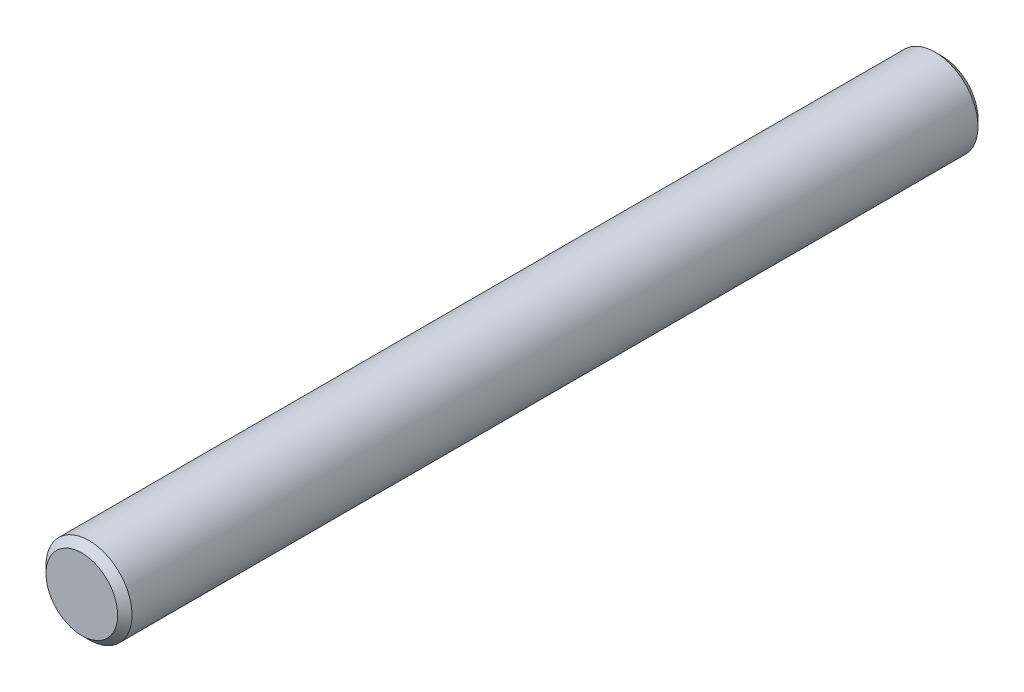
ISO-10303-21;
HEADER;
FILE_DESCRIPTION(('STEP AP214'),'2;1');
FILE_NAME('part.step','',(''),(''),'','','');
FILE_SCHEMA(('AUTOMOTIVE_DESIGN { 1 0 10303 214 1 1 1 1 }'));
ENDSEC;
DATA;
#1=APPLICATION_CONTEXT('core data for automotive mechanical design processes');
#2=APPLICATION_PROTOCOL_DEFINITION('international standard','automotive_design',2000,#1);
#3=PRODUCT_CONTEXT('',#1,'mechanical');
#4=PRODUCT('Part','Part','',(#3));
#5=PRODUCT_RELATED_PRODUCT_CATEGORY('part','',(#4));
#6=PRODUCT_DEFINITION_FORMATION('','',#4);
#7=PRODUCT_DEFINITION_CONTEXT('part definition',#1,'design');
#8=PRODUCT_DEFINITION('design','',#6,#7);
#9=PRODUCT_DEFINITION_SHAPE('','',#8);
#10=(LENGTH_UNIT() NAMED_UNIT(*) SI_UNIT(.MILLI.,.METRE.));
#11=(NAMED_UNIT(*) PLANE_ANGLE_UNIT() SI_UNIT($,.RADIAN.));
#12=(NAMED_UNIT(*) SI_UNIT($,.STERADIAN.) SOLID_ANGLE_UNIT());
#13=UNCERTAINTY_MEASURE_WITH_UNIT(LENGTH_MEASURE(1.E-05),#10,'distance_accuracy_value','');
#14=(GEOMETRIC_REPRESENTATION_CONTEXT(3) GLOBAL_UNCERTAINTY_ASSIGNED_CONTEXT((#13)) GLOBAL_UNIT_ASSIGNED_CONTEXT((#10,
#11,#12)) REPRESENTATION_CONTEXT('',''));
#15=CARTESIAN_POINT('',(0.,0.,0.));
#16=DIRECTION('',(0.,0.,1.));
#17=DIRECTION('',(1.,0.,0.));
#18=AXIS2_PLACEMENT_3D('',#15,#16,#17);
#19=CARTESIAN_POINT('',(0.,0.,0.));
#20=DIRECTION('',(0.,0.,1.));
#21=DIRECTION('',(1.,0.,0.));
#22=AXIS2_PLACEMENT_3D('',#19,#20,#21);
#23=PLANE('',#22);
#24=CARTESIAN_POINT('',(0.,0.,0.));
#25=DIRECTION('',(0.,0.,1.));
#26=DIRECTION('',(1.,0.,0.));
#27=AXIS2_PLACEMENT_3D('',#24,#25,#26);
#28=CIRCLE('',#27,4.99999999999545);
#29=CARTESIAN_POINT('',(4.99999999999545,0.,0.));
#30=VERTEX_POINT('',#29);
#31=EDGE_CURVE('E18',#30,#30,#28,.T.);
#32=ORIENTED_EDGE('',*,*,#31,.F.);
#33=EDGE_LOOP('',(#32));
#34=FACE_BOUND('',#33,.T.);
#35=ADVANCED_FACE('F15',(#34),#23,.F.);
#36=CARTESIAN_POINT('',(0.,0.,120.));
#37=DIRECTION('',(0.,0.,1.));
#38=DIRECTION('',(1.,0.,0.));
#39=AXIS2_PLACEMENT_3D('',#36,#37,#38);
#40=PLANE('',#39);
#41=CARTESIAN_POINT('',(0.,0.,120.000000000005));
#42=DIRECTION('',(0.,0.,-1.));
#43=DIRECTION('',(0.,1.,0.));
#44=AXIS2_PLACEMENT_3D('',#41,#42,#43);
#45=CIRCLE('',#44,4.99999999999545);
#46=CARTESIAN_POINT('',(0.,4.99999999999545,120.000000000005));
#47=VERTEX_POINT('',#46);
#48=EDGE_CURVE('E27',#47,#47,#45,.T.);
#49=ORIENTED_EDGE('',*,*,#48,.F.);
#50=EDGE_LOOP('',(#49));
#51=FACE_BOUND('',#50,.T.);
#52=ADVANCED_FACE('F43',(#51),#40,.T.);
#53=CARTESIAN_POINT('',(0.,0.,1.0000000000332));
#54=DIRECTION('',(0.,0.,1.));
#55=DIRECTION('',(1.,0.,0.));
#56=AXIS2_PLACEMENT_3D('',#53,#54,#55);
#57=CONICAL_SURFACE('',#56,5.99999999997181,0.785398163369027);
#58=ORIENTED_EDGE('',*,*,#31,.T.);
#59=EDGE_LOOP('',(#58));
#60=FACE_BOUND('',#59,.T.);
#61=CARTESIAN_POINT('',(0.,0.,1.));
#62=DIRECTION('',(0.,0.,1.));
#63=DIRECTION('',(1.,0.,0.));
#64=AXIS2_PLACEMENT_3D('',#61,#62,#63);
#65=CIRCLE('',#64,6.);
#66=CARTESIAN_POINT('',(6.,0.,1.));
#67=VERTEX_POINT('',#66);
#68=EDGE_CURVE('E22',#67,#67,#65,.T.);
#69=ORIENTED_EDGE('',*,*,#68,.F.);
#70=EDGE_LOOP('',(#69));
#71=FACE_BOUND('',#70,.T.);
#72=ADVANCED_FACE('F39',(#60,#71),#57,.T.);
#73=CARTESIAN_POINT('',(0.,0.,118.999999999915));
#74=DIRECTION('',(0.,0.,-1.));
#75=DIRECTION('',(0.,1.,0.));
#76=AXIS2_PLACEMENT_3D('',#73,#74,#75);
#77=CONICAL_SURFACE('',#76,6.00000000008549,0.785398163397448);
#78=ORIENTED_EDGE('',*,*,#48,.T.);
#79=EDGE_LOOP('',(#78));
#80=FACE_BOUND('',#79,.T.);
#81=CARTESIAN_POINT('',(0.,0.,119.));
#82=DIRECTION('',(0.,0.,1.));
#83=DIRECTION('',(1.,0.,0.));
#84=AXIS2_PLACEMENT_3D('',#81,#82,#83);
#85=CIRCLE('',#84,6.);
#86=CARTESIAN_POINT('',(6.,0.,119.));
#87=VERTEX_POINT('',#86);
#88=EDGE_CURVE('E10',#87,#87,#85,.F.);
#89=ORIENTED_EDGE('',*,*,#88,.F.);
#90=EDGE_LOOP('',(#89));
#91=FACE_BOUND('',#90,.T.);
#92=ADVANCED_FACE('F51',(#80,#91),#77,.T.);
#93=CARTESIAN_POINT('',(0.,0.,0.));
#94=DIRECTION('',(0.,0.,1.));
#95=DIRECTION('',(1.,0.,0.));
#96=AXIS2_PLACEMENT_3D('',#93,#94,#95);
#97=CYLINDRICAL_SURFACE('',#96,6.);
#98=ORIENTED_EDGE('',*,*,#88,.T.);
#99=EDGE_LOOP('',(#98));
#100=FACE_BOUND('',#99,.T.);
#101=ORIENTED_EDGE('',*,*,#68,.T.);
#102=EDGE_LOOP('',(#101));
#103=FACE_BOUND('',#102,.T.);
#104=ADVANCED_FACE('F49',(#100,#103),#97,.T.);
#105=CLOSED_SHELL('',(#35,#52,#72,#92,#104));
#106=MANIFOLD_SOLID_BREP('B1',#105);
#107=ADVANCED_BREP_SHAPE_REPRESENTATION('',(#18,#106),#14);
#108=SHAPE_DEFINITION_REPRESENTATION(#9,#107);
ENDSEC;
END-ISO-10303-21;
